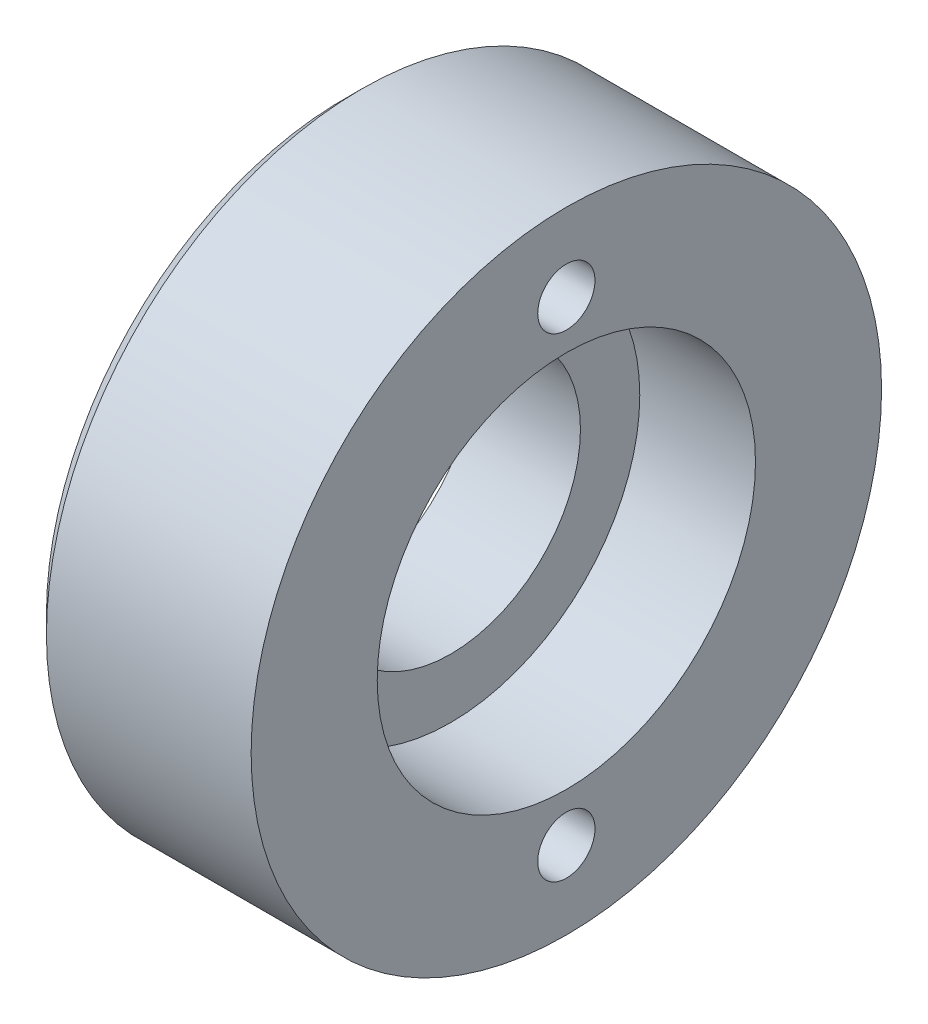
from build123d import *

# Parameters (mm, degrees)
SKETCH2_R          = 2.4511
CUT_EXTRUDE1_DEPTH = 43.656216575
CIRPATTERN1_COUNT  = 2
CHAMFER1_SIZE      = 1.524


with BuildPart() as part:
    # Sketch1 → Revolve1 (revolve)
    with BuildSketch(Plane.XY, mode=Mode.PRIVATE) as revolve1_sk:
        Polygon((-9.906, -16.1925), (-9.906, -11.1125), (-19.05, -11.1125), (-19.05, -26.9875), (0, -26.9875), (0, -16.1925), align=None)
    revolve(revolve1_sk.sketch.rotate(Axis((0, 0, 0), (1, 0, 0)), 270), axis=Axis((0, 0, 0), (1, 0, 0)))

    # Sketch2 → Cut-Extrude1 (cut, through all)
    with BuildSketch(Plane.ZY.offset(19.05)):
        with Locations((0, 20.32)):
            Circle(SKETCH2_R)
    cut_extrude1 = extrude(amount=-CUT_EXTRUDE1_DEPTH, mode=Mode.SUBTRACT)

    # CirPattern1: Cut-Extrude1 ×2 about axis
    cirpattern1_axis = Axis((0, 0, 0), (1, 0, 0))
    for i in range(1, CIRPATTERN1_COUNT):
        add(cut_extrude1.rotate(cirpattern1_axis, i * 360 / CIRPATTERN1_COUNT), mode=Mode.SUBTRACT)

    # Chamfer1
    chamfer1_edges = [part.edges().sort_by_distance(p)[0] for p in [
        (-19.05, 0, -26.9875),
    ]]
    chamfer(chamfer1_edges, length=CHAMFER1_SIZE)


solid = part.part
